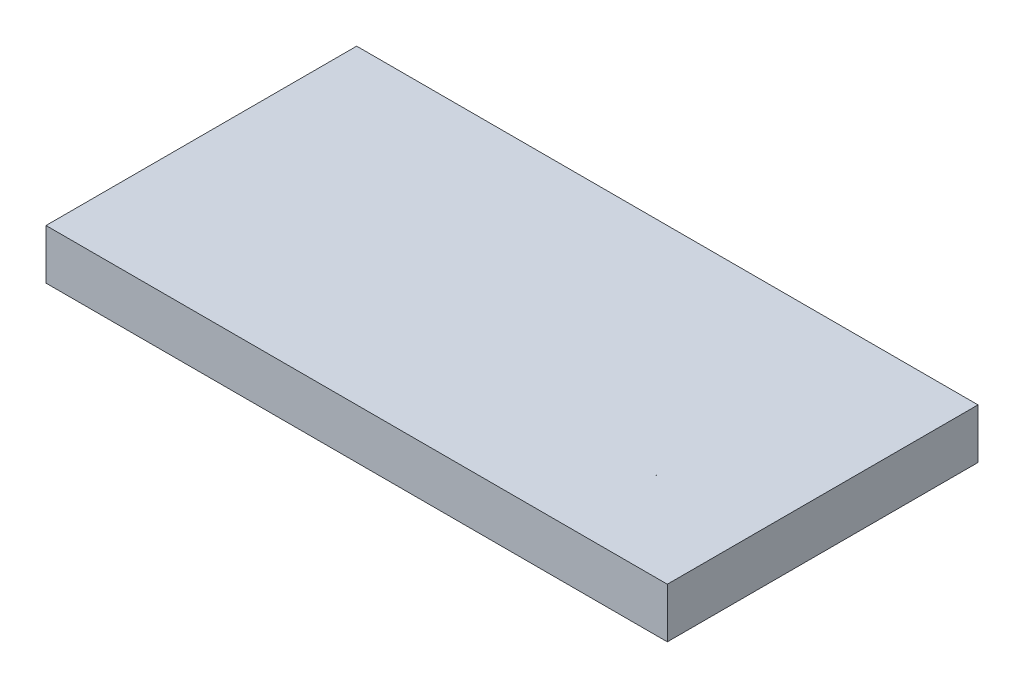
ISO-10303-21;
HEADER;
FILE_DESCRIPTION(('STEP AP214'),'2;1');
FILE_NAME('part.step','',(''),(''),'','','');
FILE_SCHEMA(('AUTOMOTIVE_DESIGN { 1 0 10303 214 1 1 1 1 }'));
ENDSEC;
DATA;
#1=APPLICATION_CONTEXT('core data for automotive mechanical design processes');
#2=APPLICATION_PROTOCOL_DEFINITION('international standard','automotive_design',2000,#1);
#3=PRODUCT_CONTEXT('',#1,'mechanical');
#4=PRODUCT('Part','Part','',(#3));
#5=PRODUCT_RELATED_PRODUCT_CATEGORY('part','',(#4));
#6=PRODUCT_DEFINITION_FORMATION('','',#4);
#7=PRODUCT_DEFINITION_CONTEXT('part definition',#1,'design');
#8=PRODUCT_DEFINITION('design','',#6,#7);
#9=PRODUCT_DEFINITION_SHAPE('','',#8);
#10=(LENGTH_UNIT() NAMED_UNIT(*) SI_UNIT(.MILLI.,.METRE.));
#11=(NAMED_UNIT(*) PLANE_ANGLE_UNIT() SI_UNIT($,.RADIAN.));
#12=(NAMED_UNIT(*) SI_UNIT($,.STERADIAN.) SOLID_ANGLE_UNIT());
#13=UNCERTAINTY_MEASURE_WITH_UNIT(LENGTH_MEASURE(1.E-05),#10,'distance_accuracy_value','');
#14=(GEOMETRIC_REPRESENTATION_CONTEXT(3) GLOBAL_UNCERTAINTY_ASSIGNED_CONTEXT((#13)) GLOBAL_UNIT_ASSIGNED_CONTEXT((#10,
#11,#12)) REPRESENTATION_CONTEXT('',''));
#15=CARTESIAN_POINT('',(0.,0.,0.));
#16=DIRECTION('',(0.,0.,1.));
#17=DIRECTION('',(1.,0.,0.));
#18=AXIS2_PLACEMENT_3D('',#15,#16,#17);
#19=CARTESIAN_POINT('',(-177.8,15.875,-88.9000000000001));
#20=DIRECTION('',(-1.,0.,0.));
#21=DIRECTION('',(0.,0.,1.));
#22=AXIS2_PLACEMENT_3D('',#19,#20,#21);
#23=PLANE('',#22);
#24=DIRECTION('',(0.,-1.,0.));
#25=VECTOR('',#24,1.);
#26=CARTESIAN_POINT('',(-177.8,15.875,88.9000000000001));
#27=LINE('',#26,#25);
#28=CARTESIAN_POINT('',(-177.8,15.875,88.9000000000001));
#29=VERTEX_POINT('',#28);
#30=CARTESIAN_POINT('',(-177.8,-12.7,88.9000000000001));
#31=VERTEX_POINT('',#30);
#32=EDGE_CURVE('E137',#29,#31,#27,.T.);
#33=ORIENTED_EDGE('',*,*,#32,.F.);
#34=DIRECTION('',(0.,0.,1.));
#35=VECTOR('',#34,1.);
#36=CARTESIAN_POINT('',(-177.8,15.875,-88.9000000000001));
#37=LINE('',#36,#35);
#38=CARTESIAN_POINT('',(-177.8,15.875,-88.9000000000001));
#39=VERTEX_POINT('',#38);
#40=EDGE_CURVE('E11',#39,#29,#37,.T.);
#41=ORIENTED_EDGE('',*,*,#40,.F.);
#42=DIRECTION('',(0.,-1.,0.));
#43=VECTOR('',#42,1.);
#44=CARTESIAN_POINT('',(-177.8,15.875,-88.9000000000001));
#45=LINE('',#44,#43);
#46=CARTESIAN_POINT('',(-177.8,-12.7,-88.9000000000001));
#47=VERTEX_POINT('',#46);
#48=EDGE_CURVE('E145',#39,#47,#45,.T.);
#49=ORIENTED_EDGE('',*,*,#48,.T.);
#50=DIRECTION('',(0.,0.,-1.));
#51=VECTOR('',#50,1.);
#52=CARTESIAN_POINT('',(-177.8,-12.7,88.9000000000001));
#53=LINE('',#52,#51);
#54=EDGE_CURVE('E131',#31,#47,#53,.T.);
#55=ORIENTED_EDGE('',*,*,#54,.F.);
#56=EDGE_LOOP('',(#33,#41,#49,#55));
#57=FACE_BOUND('',#56,.T.);
#58=ADVANCED_FACE('F28',(#57),#23,.T.);
#59=CARTESIAN_POINT('',(-177.8,15.875,-88.9000000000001));
#60=DIRECTION('',(0.,1.,0.));
#61=DIRECTION('',(0.,0.,1.));
#62=AXIS2_PLACEMENT_3D('',#59,#60,#61);
#63=PLANE('',#62);
#64=CARTESIAN_POINT('',(-19.0499999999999,15.875,38.1000000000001));
#65=DIRECTION('',(0.,1.,0.));
#66=DIRECTION('',(0.,0.,1.));
#67=AXIS2_PLACEMENT_3D('',#64,#65,#66);
#68=CIRCLE('',#67,0.0749299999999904);
#69=CARTESIAN_POINT('',(-19.0499999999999,15.875,38.1749300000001));
#70=VERTEX_POINT('',#69);
#71=EDGE_CURVE('E164',#70,#70,#68,.T.);
#72=ORIENTED_EDGE('',*,*,#71,.F.);
#73=EDGE_LOOP('',(#72));
#74=FACE_BOUND('',#73,.T.);
#75=CARTESIAN_POINT('',(-19.05,15.875,-38.0999999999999));
#76=DIRECTION('',(0.,1.,0.));
#77=DIRECTION('',(0.,0.,1.));
#78=AXIS2_PLACEMENT_3D('',#75,#76,#77);
#79=CIRCLE('',#78,0.0749299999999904);
#80=CARTESIAN_POINT('',(-19.05,15.875,-38.0250699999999));
#81=VERTEX_POINT('',#80);
#82=EDGE_CURVE('E161',#81,#81,#79,.T.);
#83=ORIENTED_EDGE('',*,*,#82,.F.);
#84=EDGE_LOOP('',(#83));
#85=FACE_BOUND('',#84,.T.);
#86=CARTESIAN_POINT('',(120.65,15.875,-38.1));
#87=DIRECTION('',(0.,1.,0.));
#88=DIRECTION('',(0.,0.,1.));
#89=AXIS2_PLACEMENT_3D('',#86,#87,#88);
#90=CIRCLE('',#89,0.074929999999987);
#91=CARTESIAN_POINT('',(120.65,15.875,-38.02507));
#92=VERTEX_POINT('',#91);
#93=EDGE_CURVE('E158',#92,#92,#90,.T.);
#94=ORIENTED_EDGE('',*,*,#93,.F.);
#95=EDGE_LOOP('',(#94));
#96=FACE_BOUND('',#95,.T.);
#97=CARTESIAN_POINT('',(120.65,15.875,38.1000000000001));
#98=DIRECTION('',(0.,1.,0.));
#99=DIRECTION('',(0.,0.,1.));
#100=AXIS2_PLACEMENT_3D('',#97,#98,#99);
#101=CIRCLE('',#100,0.074929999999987);
#102=CARTESIAN_POINT('',(120.65,15.875,38.17493));
#103=VERTEX_POINT('',#102);
#104=EDGE_CURVE('E157',#103,#103,#101,.T.);
#105=ORIENTED_EDGE('',*,*,#104,.F.);
#106=EDGE_LOOP('',(#105));
#107=FACE_BOUND('',#106,.T.);
#108=DIRECTION('',(-1.,0.,0.));
#109=VECTOR('',#108,1.);
#110=CARTESIAN_POINT('',(-177.8,15.875,88.9000000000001));
#111=LINE('',#110,#109);
#112=CARTESIAN_POINT('',(177.8,15.875,88.9000000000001));
#113=VERTEX_POINT('',#112);
#114=EDGE_CURVE('E142',#113,#29,#111,.T.);
#115=ORIENTED_EDGE('',*,*,#114,.F.);
#116=DIRECTION('',(0.,0.,1.));
#117=VECTOR('',#116,1.);
#118=CARTESIAN_POINT('',(177.8,15.875,-88.9000000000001));
#119=LINE('',#118,#117);
#120=CARTESIAN_POINT('',(177.8,15.875,-88.9000000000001));
#121=VERTEX_POINT('',#120);
#122=EDGE_CURVE('E36',#121,#113,#119,.T.);
#123=ORIENTED_EDGE('',*,*,#122,.F.);
#124=DIRECTION('',(-1.,0.,0.));
#125=VECTOR('',#124,1.);
#126=CARTESIAN_POINT('',(-177.8,15.875,-88.9000000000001));
#127=LINE('',#126,#125);
#128=EDGE_CURVE('E150',#121,#39,#127,.T.);
#129=ORIENTED_EDGE('',*,*,#128,.T.);
#130=ORIENTED_EDGE('',*,*,#40,.T.);
#131=EDGE_LOOP('',(#115,#123,#129,#130));
#132=FACE_BOUND('',#131,.T.);
#133=ADVANCED_FACE('F184',(#74,#85,#96,#107,#132),#63,.T.);
#134=CARTESIAN_POINT('',(177.8,15.875,-88.9000000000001));
#135=DIRECTION('',(1.,0.,0.));
#136=DIRECTION('',(0.,0.,-1.));
#137=AXIS2_PLACEMENT_3D('',#134,#135,#136);
#138=PLANE('',#137);
#139=DIRECTION('',(0.,1.,0.));
#140=VECTOR('',#139,1.);
#141=CARTESIAN_POINT('',(177.8,15.875,88.9000000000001));
#142=LINE('',#141,#140);
#143=CARTESIAN_POINT('',(177.8,-12.7,88.9000000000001));
#144=VERTEX_POINT('',#143);
#145=EDGE_CURVE('E139',#144,#113,#142,.T.);
#146=ORIENTED_EDGE('',*,*,#145,.F.);
#147=DIRECTION('',(0.,0.,1.));
#148=VECTOR('',#147,1.);
#149=CARTESIAN_POINT('',(177.8,-12.7,-88.9000000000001));
#150=LINE('',#149,#148);
#151=CARTESIAN_POINT('',(177.8,-12.7,-88.9000000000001));
#152=VERTEX_POINT('',#151);
#153=EDGE_CURVE('E125',#152,#144,#150,.T.);
#154=ORIENTED_EDGE('',*,*,#153,.F.);
#155=DIRECTION('',(0.,1.,0.));
#156=VECTOR('',#155,1.);
#157=CARTESIAN_POINT('',(177.8,15.875,-88.9000000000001));
#158=LINE('',#157,#156);
#159=EDGE_CURVE('E147',#152,#121,#158,.T.);
#160=ORIENTED_EDGE('',*,*,#159,.T.);
#161=ORIENTED_EDGE('',*,*,#122,.T.);
#162=EDGE_LOOP('',(#146,#154,#160,#161));
#163=FACE_BOUND('',#162,.T.);
#164=ADVANCED_FACE('F187',(#163),#138,.T.);
#165=CARTESIAN_POINT('',(-177.8,0.,-88.9000000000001));
#166=DIRECTION('',(0.,0.,1.));
#167=DIRECTION('',(1.,0.,0.));
#168=AXIS2_PLACEMENT_3D('',#165,#166,#167);
#169=PLANE('',#168);
#170=ORIENTED_EDGE('',*,*,#48,.F.);
#171=ORIENTED_EDGE('',*,*,#128,.F.);
#172=ORIENTED_EDGE('',*,*,#159,.F.);
#173=DIRECTION('',(1.,0.,0.));
#174=VECTOR('',#173,1.);
#175=CARTESIAN_POINT('',(-177.8,-12.7,-88.9000000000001));
#176=LINE('',#175,#174);
#177=EDGE_CURVE('E134',#47,#152,#176,.T.);
#178=ORIENTED_EDGE('',*,*,#177,.F.);
#179=EDGE_LOOP('',(#170,#171,#172,#178));
#180=FACE_BOUND('',#179,.T.);
#181=ADVANCED_FACE('F201',(#180),#169,.F.);
#182=CARTESIAN_POINT('',(-177.8,0.,88.9000000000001));
#183=DIRECTION('',(0.,0.,1.));
#184=DIRECTION('',(1.,0.,0.));
#185=AXIS2_PLACEMENT_3D('',#182,#183,#184);
#186=PLANE('',#185);
#187=ORIENTED_EDGE('',*,*,#32,.T.);
#188=DIRECTION('',(-1.,0.,0.));
#189=VECTOR('',#188,1.);
#190=CARTESIAN_POINT('',(177.8,-12.7,88.9000000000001));
#191=LINE('',#190,#189);
#192=EDGE_CURVE('E128',#144,#31,#191,.T.);
#193=ORIENTED_EDGE('',*,*,#192,.F.);
#194=ORIENTED_EDGE('',*,*,#145,.T.);
#195=ORIENTED_EDGE('',*,*,#114,.T.);
#196=EDGE_LOOP('',(#187,#193,#194,#195));
#197=FACE_BOUND('',#196,.T.);
#198=ADVANCED_FACE('F193',(#197),#186,.T.);
#199=CARTESIAN_POINT('',(177.8,-12.7,88.9000000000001));
#200=DIRECTION('',(0.,-1.,0.));
#201=DIRECTION('',(0.,0.,-1.));
#202=AXIS2_PLACEMENT_3D('',#199,#200,#201);
#203=PLANE('',#202);
#204=ORIENTED_EDGE('',*,*,#153,.T.);
#205=ORIENTED_EDGE('',*,*,#192,.T.);
#206=ORIENTED_EDGE('',*,*,#54,.T.);
#207=ORIENTED_EDGE('',*,*,#177,.T.);
#208=EDGE_LOOP('',(#204,#205,#206,#207));
#209=FACE_BOUND('',#208,.T.);
#210=DIRECTION('',(-1.,0.,0.));
#211=VECTOR('',#210,1.);
#212=CARTESIAN_POINT('',(152.4,-12.7,63.5000000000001));
#213=LINE('',#212,#211);
#214=CARTESIAN_POINT('',(152.4,-12.7,63.5000000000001));
#215=VERTEX_POINT('',#214);
#216=CARTESIAN_POINT('',(-152.4,-12.7,63.5000000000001));
#217=VERTEX_POINT('',#216);
#218=EDGE_CURVE('E112',#215,#217,#213,.T.);
#219=ORIENTED_EDGE('',*,*,#218,.F.);
#220=DIRECTION('',(0.,0.,1.));
#221=VECTOR('',#220,1.);
#222=CARTESIAN_POINT('',(152.4,-12.7,-63.5000000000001));
#223=LINE('',#222,#221);
#224=CARTESIAN_POINT('',(152.4,-12.7,-63.5000000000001));
#225=VERTEX_POINT('',#224);
#226=EDGE_CURVE('E110',#225,#215,#223,.T.);
#227=ORIENTED_EDGE('',*,*,#226,.F.);
#228=DIRECTION('',(1.,0.,0.));
#229=VECTOR('',#228,1.);
#230=CARTESIAN_POINT('',(-152.4,-12.7,-63.5000000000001));
#231=LINE('',#230,#229);
#232=CARTESIAN_POINT('',(-152.4,-12.7,-63.5000000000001));
#233=VERTEX_POINT('',#232);
#234=EDGE_CURVE('E118',#233,#225,#231,.T.);
#235=ORIENTED_EDGE('',*,*,#234,.F.);
#236=DIRECTION('',(0.,0.,-1.));
#237=VECTOR('',#236,1.);
#238=CARTESIAN_POINT('',(-152.4,-12.7,63.5000000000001));
#239=LINE('',#238,#237);
#240=EDGE_CURVE('E101',#217,#233,#239,.T.);
#241=ORIENTED_EDGE('',*,*,#240,.F.);
#242=EDGE_LOOP('',(#219,#227,#235,#241));
#243=FACE_BOUND('',#242,.T.);
#244=ADVANCED_FACE('F205',(#209,#243),#203,.T.);
#245=CARTESIAN_POINT('',(152.4,-12.7,-63.5000000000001));
#246=DIRECTION('',(-1.,0.,0.));
#247=DIRECTION('',(0.,0.,1.));
#248=AXIS2_PLACEMENT_3D('',#245,#246,#247);
#249=PLANE('',#248);
#250=DIRECTION('',(0.,0.,1.));
#251=VECTOR('',#250,1.);
#252=CARTESIAN_POINT('',(152.4,0.,-63.5000000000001));
#253=LINE('',#252,#251);
#254=CARTESIAN_POINT('',(152.4,0.,-63.5000000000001));
#255=VERTEX_POINT('',#254);
#256=CARTESIAN_POINT('',(152.4,0.,63.5000000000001));
#257=VERTEX_POINT('',#256);
#258=EDGE_CURVE('E44',#255,#257,#253,.T.);
#259=ORIENTED_EDGE('',*,*,#258,.F.);
#260=DIRECTION('',(0.,1.,0.));
#261=VECTOR('',#260,1.);
#262=CARTESIAN_POINT('',(152.4,-12.7,-63.5000000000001));
#263=LINE('',#262,#261);
#264=EDGE_CURVE('E105',#225,#255,#263,.T.);
#265=ORIENTED_EDGE('',*,*,#264,.F.);
#266=ORIENTED_EDGE('',*,*,#226,.T.);
#267=DIRECTION('',(0.,1.,0.));
#268=VECTOR('',#267,1.);
#269=CARTESIAN_POINT('',(152.4,-12.7,63.5000000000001));
#270=LINE('',#269,#268);
#271=EDGE_CURVE('E122',#215,#257,#270,.T.);
#272=ORIENTED_EDGE('',*,*,#271,.T.);
#273=EDGE_LOOP('',(#259,#265,#266,#272));
#274=FACE_BOUND('',#273,.T.);
#275=ADVANCED_FACE('F208',(#274),#249,.T.);
#276=CARTESIAN_POINT('',(152.4,-12.7,63.5000000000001));
#277=DIRECTION('',(0.,0.,-1.));
#278=DIRECTION('',(-1.,0.,0.));
#279=AXIS2_PLACEMENT_3D('',#276,#277,#278);
#280=PLANE('',#279);
#281=DIRECTION('',(-1.,0.,0.));
#282=VECTOR('',#281,1.);
#283=CARTESIAN_POINT('',(152.4,0.,63.5000000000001));
#284=LINE('',#283,#282);
#285=CARTESIAN_POINT('',(-152.4,0.,63.5000000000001));
#286=VERTEX_POINT('',#285);
#287=EDGE_CURVE('E48',#257,#286,#284,.T.);
#288=ORIENTED_EDGE('',*,*,#287,.F.);
#289=ORIENTED_EDGE('',*,*,#271,.F.);
#290=ORIENTED_EDGE('',*,*,#218,.T.);
#291=DIRECTION('',(0.,1.,0.));
#292=VECTOR('',#291,1.);
#293=CARTESIAN_POINT('',(-152.4,-12.7,63.5000000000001));
#294=LINE('',#293,#292);
#295=EDGE_CURVE('E104',#217,#286,#294,.T.);
#296=ORIENTED_EDGE('',*,*,#295,.T.);
#297=EDGE_LOOP('',(#288,#289,#290,#296));
#298=FACE_BOUND('',#297,.T.);
#299=ADVANCED_FACE('F214',(#298),#280,.T.);
#300=CARTESIAN_POINT('',(-152.4,-12.7,63.5000000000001));
#301=DIRECTION('',(1.,0.,0.));
#302=DIRECTION('',(0.,0.,-1.));
#303=AXIS2_PLACEMENT_3D('',#300,#301,#302);
#304=PLANE('',#303);
#305=DIRECTION('',(0.,0.,-1.));
#306=VECTOR('',#305,1.);
#307=CARTESIAN_POINT('',(-152.4,0.,63.5000000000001));
#308=LINE('',#307,#306);
#309=CARTESIAN_POINT('',(-152.4,0.,-63.5000000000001));
#310=VERTEX_POINT('',#309);
#311=EDGE_CURVE('E89',#286,#310,#308,.T.);
#312=ORIENTED_EDGE('',*,*,#311,.F.);
#313=ORIENTED_EDGE('',*,*,#295,.F.);
#314=ORIENTED_EDGE('',*,*,#240,.T.);
#315=DIRECTION('',(0.,1.,0.));
#316=VECTOR('',#315,1.);
#317=CARTESIAN_POINT('',(-152.4,-12.7,-63.5000000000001));
#318=LINE('',#317,#316);
#319=EDGE_CURVE('E98',#233,#310,#318,.T.);
#320=ORIENTED_EDGE('',*,*,#319,.T.);
#321=EDGE_LOOP('',(#312,#313,#314,#320));
#322=FACE_BOUND('',#321,.T.);
#323=ADVANCED_FACE('F99',(#322),#304,.T.);
#324=CARTESIAN_POINT('',(-152.4,-12.7,-63.5000000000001));
#325=DIRECTION('',(0.,0.,1.));
#326=DIRECTION('',(1.,0.,0.));
#327=AXIS2_PLACEMENT_3D('',#324,#325,#326);
#328=PLANE('',#327);
#329=DIRECTION('',(1.,0.,0.));
#330=VECTOR('',#329,1.);
#331=CARTESIAN_POINT('',(-152.4,0.,-63.5000000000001));
#332=LINE('',#331,#330);
#333=EDGE_CURVE('E93',#310,#255,#332,.T.);
#334=ORIENTED_EDGE('',*,*,#333,.F.);
#335=ORIENTED_EDGE('',*,*,#319,.F.);
#336=ORIENTED_EDGE('',*,*,#234,.T.);
#337=ORIENTED_EDGE('',*,*,#264,.T.);
#338=EDGE_LOOP('',(#334,#335,#336,#337));
#339=FACE_BOUND('',#338,.T.);
#340=ADVANCED_FACE('F108',(#339),#328,.T.);
#341=CARTESIAN_POINT('',(-177.8,0.,-88.9000000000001));
#342=DIRECTION('',(0.,-1.,0.));
#343=DIRECTION('',(0.,0.,-1.));
#344=AXIS2_PLACEMENT_3D('',#341,#342,#343);
#345=PLANE('',#344);
#346=CARTESIAN_POINT('',(-19.0499999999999,0.,38.1000000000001));
#347=DIRECTION('',(0.,-1.,0.));
#348=DIRECTION('',(0.,0.,-1.));
#349=AXIS2_PLACEMENT_3D('',#346,#347,#348);
#350=CIRCLE('',#349,0.0749299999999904);
#351=CARTESIAN_POINT('',(-19.0499999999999,0.,38.0250700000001));
#352=VERTEX_POINT('',#351);
#353=EDGE_CURVE('E31',#352,#352,#350,.T.);
#354=ORIENTED_EDGE('',*,*,#353,.F.);
#355=EDGE_LOOP('',(#354));
#356=FACE_BOUND('',#355,.T.);
#357=CARTESIAN_POINT('',(-19.05,0.,-38.0999999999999));
#358=DIRECTION('',(0.,-1.,0.));
#359=DIRECTION('',(0.,0.,-1.));
#360=AXIS2_PLACEMENT_3D('',#357,#358,#359);
#361=CIRCLE('',#360,0.0749299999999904);
#362=CARTESIAN_POINT('',(-19.05,0.,-38.1749299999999));
#363=VERTEX_POINT('',#362);
#364=EDGE_CURVE('E162',#363,#363,#361,.T.);
#365=ORIENTED_EDGE('',*,*,#364,.F.);
#366=EDGE_LOOP('',(#365));
#367=FACE_BOUND('',#366,.T.);
#368=CARTESIAN_POINT('',(120.65,0.,-38.1));
#369=DIRECTION('',(0.,-1.,0.));
#370=DIRECTION('',(0.,0.,-1.));
#371=AXIS2_PLACEMENT_3D('',#368,#369,#370);
#372=CIRCLE('',#371,0.074929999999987);
#373=CARTESIAN_POINT('',(120.65,0.,-38.1749299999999));
#374=VERTEX_POINT('',#373);
#375=EDGE_CURVE('E159',#374,#374,#372,.T.);
#376=ORIENTED_EDGE('',*,*,#375,.F.);
#377=EDGE_LOOP('',(#376));
#378=FACE_BOUND('',#377,.T.);
#379=CARTESIAN_POINT('',(120.65,0.,38.1000000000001));
#380=DIRECTION('',(0.,-1.,0.));
#381=DIRECTION('',(0.,0.,-1.));
#382=AXIS2_PLACEMENT_3D('',#379,#380,#381);
#383=CIRCLE('',#382,0.074929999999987);
#384=CARTESIAN_POINT('',(120.65,0.,38.0250700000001));
#385=VERTEX_POINT('',#384);
#386=EDGE_CURVE('E154',#385,#385,#383,.T.);
#387=ORIENTED_EDGE('',*,*,#386,.F.);
#388=EDGE_LOOP('',(#387));
#389=FACE_BOUND('',#388,.T.);
#390=ORIENTED_EDGE('',*,*,#258,.T.);
#391=ORIENTED_EDGE('',*,*,#287,.T.);
#392=ORIENTED_EDGE('',*,*,#311,.T.);
#393=ORIENTED_EDGE('',*,*,#333,.T.);
#394=EDGE_LOOP('',(#390,#391,#392,#393));
#395=FACE_BOUND('',#394,.T.);
#396=ADVANCED_FACE('F91',(#356,#367,#378,#389,#395),#345,.T.);
#397=CARTESIAN_POINT('',(120.65,25.4,38.1000000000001));
#398=DIRECTION('',(0.,1.,0.));
#399=DIRECTION('',(0.,0.,1.));
#400=AXIS2_PLACEMENT_3D('',#397,#398,#399);
#401=CYLINDRICAL_SURFACE('',#400,0.074929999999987);
#402=ORIENTED_EDGE('',*,*,#104,.T.);
#403=EDGE_LOOP('',(#402));
#404=FACE_BOUND('',#403,.T.);
#405=ORIENTED_EDGE('',*,*,#386,.T.);
#406=EDGE_LOOP('',(#405));
#407=FACE_BOUND('',#406,.T.);
#408=ADVANCED_FACE('F181',(#404,#407),#401,.F.);
#409=CARTESIAN_POINT('',(120.65,25.4,-38.1));
#410=DIRECTION('',(0.,1.,0.));
#411=DIRECTION('',(0.,0.,1.));
#412=AXIS2_PLACEMENT_3D('',#409,#410,#411);
#413=CYLINDRICAL_SURFACE('',#412,0.074929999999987);
#414=ORIENTED_EDGE('',*,*,#93,.T.);
#415=EDGE_LOOP('',(#414));
#416=FACE_BOUND('',#415,.T.);
#417=ORIENTED_EDGE('',*,*,#375,.T.);
#418=EDGE_LOOP('',(#417));
#419=FACE_BOUND('',#418,.T.);
#420=ADVANCED_FACE('F276',(#416,#419),#413,.F.);
#421=CARTESIAN_POINT('',(-19.05,25.4,-38.0999999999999));
#422=DIRECTION('',(0.,1.,0.));
#423=DIRECTION('',(0.,0.,1.));
#424=AXIS2_PLACEMENT_3D('',#421,#422,#423);
#425=CYLINDRICAL_SURFACE('',#424,0.0749299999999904);
#426=ORIENTED_EDGE('',*,*,#82,.T.);
#427=EDGE_LOOP('',(#426));
#428=FACE_BOUND('',#427,.T.);
#429=ORIENTED_EDGE('',*,*,#364,.T.);
#430=EDGE_LOOP('',(#429));
#431=FACE_BOUND('',#430,.T.);
#432=ADVANCED_FACE('F284',(#428,#431),#425,.F.);
#433=CARTESIAN_POINT('',(-19.0499999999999,25.4,38.1000000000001));
#434=DIRECTION('',(0.,1.,0.));
#435=DIRECTION('',(0.,0.,1.));
#436=AXIS2_PLACEMENT_3D('',#433,#434,#435);
#437=CYLINDRICAL_SURFACE('',#436,0.0749299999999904);
#438=ORIENTED_EDGE('',*,*,#71,.T.);
#439=EDGE_LOOP('',(#438));
#440=FACE_BOUND('',#439,.T.);
#441=ORIENTED_EDGE('',*,*,#353,.T.);
#442=EDGE_LOOP('',(#441));
#443=FACE_BOUND('',#442,.T.);
#444=ADVANCED_FACE('F292',(#440,#443),#437,.F.);
#445=CLOSED_SHELL('',(#58,#133,#164,#181,#198,#244,#275,#299,#323,#340,#396,#408,#420,#432,#444));
#446=MANIFOLD_SOLID_BREP('B2',#445);
#447=ADVANCED_BREP_SHAPE_REPRESENTATION('',(#18,#446),#14);
#448=SHAPE_DEFINITION_REPRESENTATION(#9,#447);
ENDSEC;
END-ISO-10303-21;
